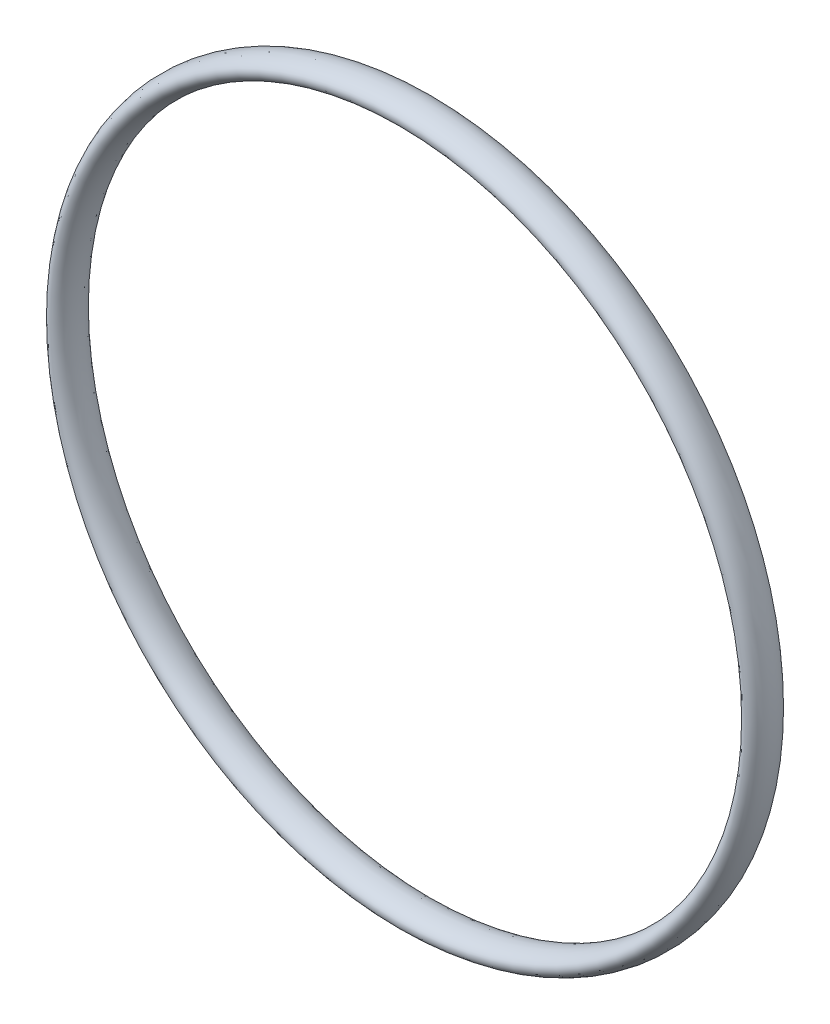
ISO-10303-21;
HEADER;
FILE_DESCRIPTION(('STEP AP214'),'2;1');
FILE_NAME('part.step','',(''),(''),'','','');
FILE_SCHEMA(('AUTOMOTIVE_DESIGN { 1 0 10303 214 1 1 1 1 }'));
ENDSEC;
DATA;
#1=APPLICATION_CONTEXT('core data for automotive mechanical design processes');
#2=APPLICATION_PROTOCOL_DEFINITION('international standard','automotive_design',2000,#1);
#3=PRODUCT_CONTEXT('',#1,'mechanical');
#4=PRODUCT('Part','Part','',(#3));
#5=PRODUCT_RELATED_PRODUCT_CATEGORY('part','',(#4));
#6=PRODUCT_DEFINITION_FORMATION('','',#4);
#7=PRODUCT_DEFINITION_CONTEXT('part definition',#1,'design');
#8=PRODUCT_DEFINITION('design','',#6,#7);
#9=PRODUCT_DEFINITION_SHAPE('','',#8);
#10=(LENGTH_UNIT() NAMED_UNIT(*) SI_UNIT(.MILLI.,.METRE.));
#11=(NAMED_UNIT(*) PLANE_ANGLE_UNIT() SI_UNIT($,.RADIAN.));
#12=(NAMED_UNIT(*) SI_UNIT($,.STERADIAN.) SOLID_ANGLE_UNIT());
#13=UNCERTAINTY_MEASURE_WITH_UNIT(LENGTH_MEASURE(1.E-05),#10,'distance_accuracy_value','');
#14=(GEOMETRIC_REPRESENTATION_CONTEXT(3) GLOBAL_UNCERTAINTY_ASSIGNED_CONTEXT((#13)) GLOBAL_UNIT_ASSIGNED_CONTEXT((#10,
#11,#12)) REPRESENTATION_CONTEXT('',''));
#15=CARTESIAN_POINT('',(0.,0.,0.));
#16=DIRECTION('',(0.,0.,1.));
#17=DIRECTION('',(1.,0.,0.));
#18=AXIS2_PLACEMENT_3D('',#15,#16,#17);
#19=CARTESIAN_POINT('',(0.,46.45,-2.4));
#20=DIRECTION('',(1.,0.,0.));
#21=DIRECTION('',(0.,0.,-1.));
#22=AXIS2_PLACEMENT_3D('',#19,#20,#21);
#23=ELLIPSE('',#22,2.4,1.45);
#24=CARTESIAN_POINT('',(0.,0.,0.));
#25=DIRECTION('',(0.,0.,1.));
#26=AXIS1_PLACEMENT('',#24,#25);
#27=SURFACE_OF_REVOLUTION('',#23,#26);
#28=ADVANCED_FACE('F28',(),#27,.T.);
#29=CLOSED_SHELL('',(#28));
#30=MANIFOLD_SOLID_BREP('B2',#29);
#31=ADVANCED_BREP_SHAPE_REPRESENTATION('',(#18,#30),#14);
#32=SHAPE_DEFINITION_REPRESENTATION(#9,#31);
ENDSEC;
END-ISO-10303-21;
